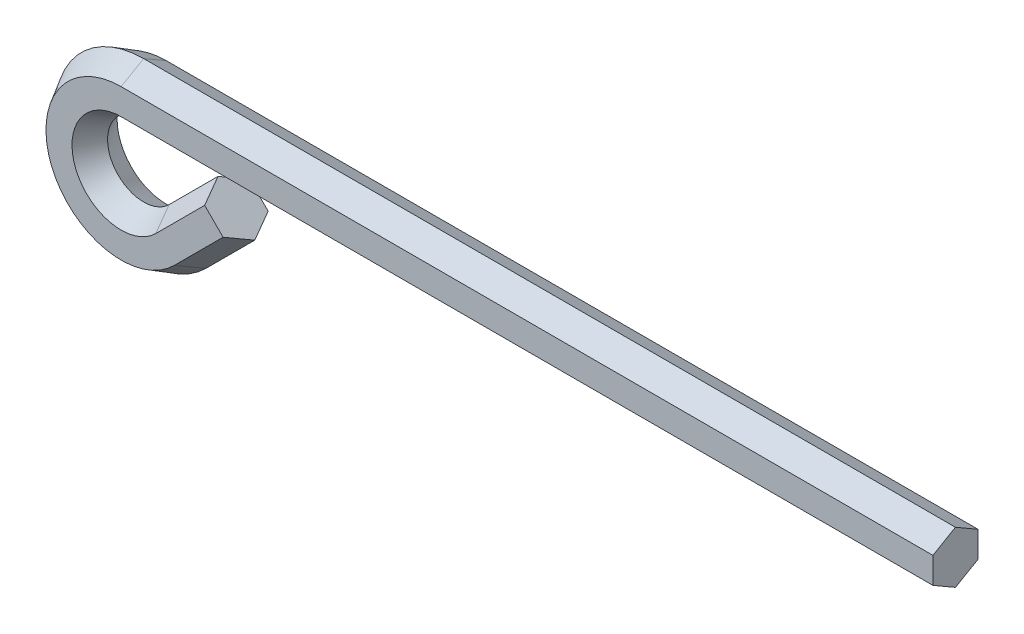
ISO-10303-21;
HEADER;
FILE_DESCRIPTION(('STEP AP214'),'2;1');
FILE_NAME('part.step','',(''),(''),'','','');
FILE_SCHEMA(('AUTOMOTIVE_DESIGN { 1 0 10303 214 1 1 1 1 }'));
ENDSEC;
DATA;
#1=APPLICATION_CONTEXT('core data for automotive mechanical design processes');
#2=APPLICATION_PROTOCOL_DEFINITION('international standard','automotive_design',2000,#1);
#3=PRODUCT_CONTEXT('',#1,'mechanical');
#4=PRODUCT('Part','Part','',(#3));
#5=PRODUCT_RELATED_PRODUCT_CATEGORY('part','',(#4));
#6=PRODUCT_DEFINITION_FORMATION('','',#4);
#7=PRODUCT_DEFINITION_CONTEXT('part definition',#1,'design');
#8=PRODUCT_DEFINITION('design','',#6,#7);
#9=PRODUCT_DEFINITION_SHAPE('','',#8);
#10=(LENGTH_UNIT() NAMED_UNIT(*) SI_UNIT(.MILLI.,.METRE.));
#11=(NAMED_UNIT(*) PLANE_ANGLE_UNIT() SI_UNIT($,.RADIAN.));
#12=(NAMED_UNIT(*) SI_UNIT($,.STERADIAN.) SOLID_ANGLE_UNIT());
#13=UNCERTAINTY_MEASURE_WITH_UNIT(LENGTH_MEASURE(1.E-05),#10,'distance_accuracy_value','');
#14=(GEOMETRIC_REPRESENTATION_CONTEXT(3) GLOBAL_UNCERTAINTY_ASSIGNED_CONTEXT((#13)) GLOBAL_UNIT_ASSIGNED_CONTEXT((#10,
#11,#12)) REPRESENTATION_CONTEXT('',''));
#15=CARTESIAN_POINT('',(0.,0.,0.));
#16=DIRECTION('',(0.,0.,1.));
#17=DIRECTION('',(1.,0.,0.));
#18=AXIS2_PLACEMENT_3D('',#15,#16,#17);
#19=CARTESIAN_POINT('',(5.89028930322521,-5.89028930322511,-2.5));
#20=DIRECTION('',(-0.612372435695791,0.612372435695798,0.5));
#21=DIRECTION('',(-0.707106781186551,-0.707106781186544,0.));
#22=AXIS2_PLACEMENT_3D('',#19,#20,#21);
#23=PLANE('',#22);
#24=DIRECTION('',(0.353553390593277,-0.353553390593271,0.866025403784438));
#25=VECTOR('',#24,1.);
#26=CARTESIAN_POINT('',(5.89028930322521,-5.89028930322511,-2.5));
#27=LINE('',#26,#25);
#28=CARTESIAN_POINT('',(5.89028930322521,-5.89028930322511,-2.5));
#29=VERTEX_POINT('',#28);
#30=CARTESIAN_POINT('',(6.91091002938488,-6.91091002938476,0.));
#31=VERTEX_POINT('',#30);
#32=EDGE_CURVE('E133',#29,#31,#27,.T.);
#33=ORIENTED_EDGE('',*,*,#32,.F.);
#34=DIRECTION('',(0.707106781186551,0.707106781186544,0.));
#35=VECTOR('',#34,1.);
#36=CARTESIAN_POINT('',(5.89028930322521,-5.89028930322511,-2.5));
#37=LINE('',#36,#35);
#38=CARTESIAN_POINT('',(11.3045028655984,-0.476075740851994,-2.5));
#39=VERTEX_POINT('',#38);
#40=EDGE_CURVE('E42',#29,#39,#37,.T.);
#41=ORIENTED_EDGE('',*,*,#40,.T.);
#42=DIRECTION('',(0.353553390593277,-0.353553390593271,0.866025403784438));
#43=VECTOR('',#42,1.);
#44=CARTESIAN_POINT('',(11.3045028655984,-0.476075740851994,-2.5));
#45=LINE('',#44,#43);
#46=CARTESIAN_POINT('',(12.3251235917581,-1.49669646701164,0.));
#47=VERTEX_POINT('',#46);
#48=EDGE_CURVE('E49',#39,#47,#45,.T.);
#49=ORIENTED_EDGE('',*,*,#48,.T.);
#50=DIRECTION('',(0.707106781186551,0.707106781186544,0.));
#51=VECTOR('',#50,1.);
#52=CARTESIAN_POINT('',(6.91091002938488,-6.91091002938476,0.));
#53=LINE('',#52,#51);
#54=EDGE_CURVE('E11',#31,#47,#53,.T.);
#55=ORIENTED_EDGE('',*,*,#54,.F.);
#56=EDGE_LOOP('',(#33,#41,#49,#55));
#57=FACE_BOUND('',#56,.T.);
#58=ADVANCED_FACE('F34',(#57),#23,.F.);
#59=CARTESIAN_POINT('',(2.82842712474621,-2.82842712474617,0.));
#60=DIRECTION('',(0.612372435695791,-0.612372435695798,0.5));
#61=DIRECTION('',(0.707106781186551,0.707106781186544,0.));
#62=AXIS2_PLACEMENT_3D('',#59,#60,#61);
#63=PLANE('',#62);
#64=DIRECTION('',(0.353553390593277,-0.353553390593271,-0.866025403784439));
#65=VECTOR('',#64,1.);
#66=CARTESIAN_POINT('',(2.82842712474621,-2.82842712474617,0.));
#67=LINE('',#66,#65);
#68=CARTESIAN_POINT('',(2.82842712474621,-2.82842712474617,0.));
#69=VERTEX_POINT('',#68);
#70=CARTESIAN_POINT('',(3.84904785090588,-3.84904785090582,-2.5));
#71=VERTEX_POINT('',#70);
#72=EDGE_CURVE('E212',#69,#71,#67,.T.);
#73=ORIENTED_EDGE('',*,*,#72,.F.);
#74=DIRECTION('',(0.707106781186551,0.707106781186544,0.));
#75=VECTOR('',#74,1.);
#76=CARTESIAN_POINT('',(2.82842712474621,-2.82842712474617,0.));
#77=LINE('',#76,#75);
#78=CARTESIAN_POINT('',(8.24264068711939,2.58578643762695,0.));
#79=VERTEX_POINT('',#78);
#80=EDGE_CURVE('E256',#69,#79,#77,.T.);
#81=ORIENTED_EDGE('',*,*,#80,.T.);
#82=DIRECTION('',(0.353553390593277,-0.353553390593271,-0.866025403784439));
#83=VECTOR('',#82,1.);
#84=CARTESIAN_POINT('',(8.24264068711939,2.58578643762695,0.));
#85=LINE('',#84,#83);
#86=CARTESIAN_POINT('',(9.26326141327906,1.5651657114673,-2.5));
#87=VERTEX_POINT('',#86);
#88=EDGE_CURVE('E243',#79,#87,#85,.T.);
#89=ORIENTED_EDGE('',*,*,#88,.T.);
#90=DIRECTION('',(0.707106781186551,0.707106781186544,0.));
#91=VECTOR('',#90,1.);
#92=CARTESIAN_POINT('',(3.84904785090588,-3.84904785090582,-2.5));
#93=LINE('',#92,#91);
#94=EDGE_CURVE('E260',#71,#87,#93,.T.);
#95=ORIENTED_EDGE('',*,*,#94,.F.);
#96=EDGE_LOOP('',(#73,#81,#89,#95));
#97=FACE_BOUND('',#96,.T.);
#98=ADVANCED_FACE('F282',(#97),#63,.F.);
#99=CARTESIAN_POINT('',(2.82842712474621,-2.82842712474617,0.));
#100=DIRECTION('',(-0.612372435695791,0.612372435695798,0.5));
#101=DIRECTION('',(-0.707106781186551,-0.707106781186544,0.));
#102=AXIS2_PLACEMENT_3D('',#99,#100,#101);
#103=PLANE('',#102);
#104=DIRECTION('',(0.353553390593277,-0.353553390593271,0.866025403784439));
#105=VECTOR('',#104,1.);
#106=CARTESIAN_POINT('',(2.82842712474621,-2.82842712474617,0.));
#107=LINE('',#106,#105);
#108=CARTESIAN_POINT('',(3.84904785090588,-3.84904785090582,2.5));
#109=VERTEX_POINT('',#108);
#110=EDGE_CURVE('E209',#69,#109,#107,.T.);
#111=ORIENTED_EDGE('',*,*,#110,.T.);
#112=DIRECTION('',(0.707106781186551,0.707106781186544,0.));
#113=VECTOR('',#112,1.);
#114=CARTESIAN_POINT('',(3.84904785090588,-3.84904785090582,2.5));
#115=LINE('',#114,#113);
#116=CARTESIAN_POINT('',(9.26326141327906,1.5651657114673,2.5));
#117=VERTEX_POINT('',#116);
#118=EDGE_CURVE('E252',#109,#117,#115,.T.);
#119=ORIENTED_EDGE('',*,*,#118,.T.);
#120=DIRECTION('',(0.353553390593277,-0.353553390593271,0.866025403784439));
#121=VECTOR('',#120,1.);
#122=CARTESIAN_POINT('',(8.24264068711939,2.58578643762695,0.));
#123=LINE('',#122,#121);
#124=EDGE_CURVE('E240',#79,#117,#123,.T.);
#125=ORIENTED_EDGE('',*,*,#124,.F.);
#126=ORIENTED_EDGE('',*,*,#80,.F.);
#127=EDGE_LOOP('',(#111,#119,#125,#126));
#128=FACE_BOUND('',#127,.T.);
#129=ADVANCED_FACE('F286',(#128),#103,.T.);
#130=CARTESIAN_POINT('',(5.89028930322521,-5.89028930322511,2.5));
#131=DIRECTION('',(0.612372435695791,-0.612372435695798,0.5));
#132=DIRECTION('',(0.707106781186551,0.707106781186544,0.));
#133=AXIS2_PLACEMENT_3D('',#130,#131,#132);
#134=PLANE('',#133);
#135=DIRECTION('',(0.353553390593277,-0.353553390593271,-0.866025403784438));
#136=VECTOR('',#135,1.);
#137=CARTESIAN_POINT('',(5.89028930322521,-5.89028930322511,2.5));
#138=LINE('',#137,#136);
#139=CARTESIAN_POINT('',(5.89028930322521,-5.89028930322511,2.5));
#140=VERTEX_POINT('',#139);
#141=EDGE_CURVE('E160',#140,#31,#138,.T.);
#142=ORIENTED_EDGE('',*,*,#141,.T.);
#143=ORIENTED_EDGE('',*,*,#54,.T.);
#144=DIRECTION('',(0.353553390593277,-0.353553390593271,-0.866025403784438));
#145=VECTOR('',#144,1.);
#146=CARTESIAN_POINT('',(11.3045028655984,-0.476075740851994,2.5));
#147=LINE('',#146,#145);
#148=CARTESIAN_POINT('',(11.3045028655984,-0.476075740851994,2.5));
#149=VERTEX_POINT('',#148);
#150=EDGE_CURVE('E137',#149,#47,#147,.T.);
#151=ORIENTED_EDGE('',*,*,#150,.F.);
#152=DIRECTION('',(0.707106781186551,0.707106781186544,0.));
#153=VECTOR('',#152,1.);
#154=CARTESIAN_POINT('',(5.89028930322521,-5.89028930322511,2.5));
#155=LINE('',#154,#153);
#156=EDGE_CURVE('E249',#140,#149,#155,.T.);
#157=ORIENTED_EDGE('',*,*,#156,.F.);
#158=EDGE_LOOP('',(#142,#143,#151,#157));
#159=FACE_BOUND('',#158,.T.);
#160=ADVANCED_FACE('F291',(#159),#134,.T.);
#161=CARTESIAN_POINT('',(0.,0.,-2.5));
#162=DIRECTION('',(0.,0.,1.));
#163=DIRECTION('',(1.,0.,0.));
#164=AXIS2_PLACEMENT_3D('',#161,#162,#163);
#165=CONICAL_SURFACE('',#164,8.33012701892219,0.523598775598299);
#166=DIRECTION('',(0.,0.5,0.866025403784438));
#167=VECTOR('',#166,1.);
#168=CARTESIAN_POINT('',(0.,8.33012701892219,-2.5));
#169=LINE('',#168,#167);
#170=CARTESIAN_POINT('',(0.,8.33012701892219,-2.5));
#171=VERTEX_POINT('',#170);
#172=CARTESIAN_POINT('',(0.,9.77350269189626,0.));
#173=VERTEX_POINT('',#172);
#174=EDGE_CURVE('E130',#171,#173,#169,.T.);
#175=ORIENTED_EDGE('',*,*,#174,.F.);
#176=CARTESIAN_POINT('',(0.,0.,-2.5));
#177=DIRECTION('',(0.,0.,1.));
#178=DIRECTION('',(1.,0.,0.));
#179=AXIS2_PLACEMENT_3D('',#176,#177,#178);
#180=CIRCLE('',#179,8.33012701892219);
#181=EDGE_CURVE('E138',#171,#29,#180,.T.);
#182=ORIENTED_EDGE('',*,*,#181,.T.);
#183=ORIENTED_EDGE('',*,*,#32,.T.);
#184=CARTESIAN_POINT('',(0.,0.,0.));
#185=DIRECTION('',(0.,0.,1.));
#186=DIRECTION('',(1.,0.,0.));
#187=AXIS2_PLACEMENT_3D('',#184,#185,#186);
#188=CIRCLE('',#187,9.77350269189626);
#189=EDGE_CURVE('E125',#173,#31,#188,.T.);
#190=ORIENTED_EDGE('',*,*,#189,.F.);
#191=EDGE_LOOP('',(#175,#182,#183,#190));
#192=FACE_BOUND('',#191,.T.);
#193=ADVANCED_FACE('F127',(#192),#165,.T.);
#194=CARTESIAN_POINT('',(0.,0.,0.));
#195=DIRECTION('',(0.,0.,-1.));
#196=DIRECTION('',(-1.,0.,0.));
#197=AXIS2_PLACEMENT_3D('',#194,#195,#196);
#198=CONICAL_SURFACE('',#197,4.,0.523598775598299);
#199=DIRECTION('',(0.,0.5,-0.866025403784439));
#200=VECTOR('',#199,1.);
#201=CARTESIAN_POINT('',(0.,4.,0.));
#202=LINE('',#201,#200);
#203=CARTESIAN_POINT('',(0.,4.,0.));
#204=VERTEX_POINT('',#203);
#205=CARTESIAN_POINT('',(0.,5.44337567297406,-2.5));
#206=VERTEX_POINT('',#205);
#207=EDGE_CURVE('E165',#204,#206,#202,.T.);
#208=ORIENTED_EDGE('',*,*,#207,.F.);
#209=CARTESIAN_POINT('',(0.,0.,0.));
#210=DIRECTION('',(0.,0.,1.));
#211=DIRECTION('',(1.,0.,0.));
#212=AXIS2_PLACEMENT_3D('',#209,#210,#211);
#213=CIRCLE('',#212,4.);
#214=EDGE_CURVE('E224',#204,#69,#213,.T.);
#215=ORIENTED_EDGE('',*,*,#214,.T.);
#216=ORIENTED_EDGE('',*,*,#72,.T.);
#217=CARTESIAN_POINT('',(0.,0.,-2.5));
#218=DIRECTION('',(0.,0.,1.));
#219=DIRECTION('',(1.,0.,0.));
#220=AXIS2_PLACEMENT_3D('',#217,#218,#219);
#221=CIRCLE('',#220,5.44337567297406);
#222=EDGE_CURVE('E228',#206,#71,#221,.T.);
#223=ORIENTED_EDGE('',*,*,#222,.F.);
#224=EDGE_LOOP('',(#208,#215,#216,#223));
#225=FACE_BOUND('',#224,.T.);
#226=ADVANCED_FACE('F278',(#225),#198,.F.);
#227=CARTESIAN_POINT('',(0.,0.,0.));
#228=DIRECTION('',(0.,0.,1.));
#229=DIRECTION('',(1.,0.,0.));
#230=AXIS2_PLACEMENT_3D('',#227,#228,#229);
#231=CONICAL_SURFACE('',#230,4.,0.523598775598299);
#232=DIRECTION('',(0.,0.5,0.866025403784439));
#233=VECTOR('',#232,1.);
#234=CARTESIAN_POINT('',(0.,4.,0.));
#235=LINE('',#234,#233);
#236=CARTESIAN_POINT('',(0.,5.44337567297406,2.5));
#237=VERTEX_POINT('',#236);
#238=EDGE_CURVE('E172',#204,#237,#235,.T.);
#239=ORIENTED_EDGE('',*,*,#238,.T.);
#240=CARTESIAN_POINT('',(0.,0.,2.5));
#241=DIRECTION('',(0.,0.,1.));
#242=DIRECTION('',(1.,0.,0.));
#243=AXIS2_PLACEMENT_3D('',#240,#241,#242);
#244=CIRCLE('',#243,5.44337567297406);
#245=EDGE_CURVE('E220',#237,#109,#244,.T.);
#246=ORIENTED_EDGE('',*,*,#245,.T.);
#247=ORIENTED_EDGE('',*,*,#110,.F.);
#248=ORIENTED_EDGE('',*,*,#214,.F.);
#249=EDGE_LOOP('',(#239,#246,#247,#248));
#250=FACE_BOUND('',#249,.T.);
#251=ADVANCED_FACE('F284',(#250),#231,.F.);
#252=CARTESIAN_POINT('',(0.,0.,2.5));
#253=DIRECTION('',(0.,0.,-1.));
#254=DIRECTION('',(-1.,0.,0.));
#255=AXIS2_PLACEMENT_3D('',#252,#253,#254);
#256=CONICAL_SURFACE('',#255,8.33012701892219,0.523598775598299);
#257=DIRECTION('',(0.,0.5,-0.866025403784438));
#258=VECTOR('',#257,1.);
#259=CARTESIAN_POINT('',(0.,8.33012701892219,2.5));
#260=LINE('',#259,#258);
#261=CARTESIAN_POINT('',(0.,8.33012701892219,2.5));
#262=VERTEX_POINT('',#261);
#263=EDGE_CURVE('E141',#262,#173,#260,.T.);
#264=ORIENTED_EDGE('',*,*,#263,.T.);
#265=ORIENTED_EDGE('',*,*,#189,.T.);
#266=ORIENTED_EDGE('',*,*,#141,.F.);
#267=CARTESIAN_POINT('',(0.,0.,2.5));
#268=DIRECTION('',(0.,0.,1.));
#269=DIRECTION('',(1.,0.,0.));
#270=AXIS2_PLACEMENT_3D('',#267,#268,#269);
#271=CIRCLE('',#270,8.33012701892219);
#272=EDGE_CURVE('E145',#262,#140,#271,.T.);
#273=ORIENTED_EDGE('',*,*,#272,.F.);
#274=EDGE_LOOP('',(#264,#265,#266,#273));
#275=FACE_BOUND('',#274,.T.);
#276=ADVANCED_FACE('F143',(#275),#256,.T.);
#277=CARTESIAN_POINT('',(0.,8.33012701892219,2.5));
#278=DIRECTION('',(0.,-0.866025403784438,-0.5));
#279=DIRECTION('',(0.,0.5,-0.866025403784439));
#280=AXIS2_PLACEMENT_3D('',#277,#278,#279);
#281=PLANE('',#280);
#282=DIRECTION('',(0.,0.5,-0.866025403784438));
#283=VECTOR('',#282,1.);
#284=CARTESIAN_POINT('',(90.,8.3301270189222,2.5));
#285=LINE('',#284,#283);
#286=CARTESIAN_POINT('',(90.,8.3301270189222,2.5));
#287=VERTEX_POINT('',#286);
#288=CARTESIAN_POINT('',(90.,9.77350269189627,0.));
#289=VERTEX_POINT('',#288);
#290=EDGE_CURVE('E155',#287,#289,#285,.T.);
#291=ORIENTED_EDGE('',*,*,#290,.T.);
#292=DIRECTION('',(1.,0.,0.));
#293=VECTOR('',#292,1.);
#294=CARTESIAN_POINT('',(0.,9.77350269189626,0.));
#295=LINE('',#294,#293);
#296=EDGE_CURVE('E152',#173,#289,#295,.T.);
#297=ORIENTED_EDGE('',*,*,#296,.F.);
#298=ORIENTED_EDGE('',*,*,#263,.F.);
#299=DIRECTION('',(1.,0.,0.));
#300=VECTOR('',#299,1.);
#301=CARTESIAN_POINT('',(0.,8.33012701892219,2.5));
#302=LINE('',#301,#300);
#303=EDGE_CURVE('E178',#262,#287,#302,.T.);
#304=ORIENTED_EDGE('',*,*,#303,.T.);
#305=EDGE_LOOP('',(#291,#297,#298,#304));
#306=FACE_BOUND('',#305,.T.);
#307=ADVANCED_FACE('F153',(#306),#281,.F.);
#308=CARTESIAN_POINT('',(0.,8.33012701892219,-2.5));
#309=DIRECTION('',(0.,0.866025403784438,-0.5));
#310=DIRECTION('',(0.,0.5,0.866025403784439));
#311=AXIS2_PLACEMENT_3D('',#308,#309,#310);
#312=PLANE('',#311);
#313=DIRECTION('',(0.,0.5,0.866025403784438));
#314=VECTOR('',#313,1.);
#315=CARTESIAN_POINT('',(90.,8.3301270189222,-2.5));
#316=LINE('',#315,#314);
#317=CARTESIAN_POINT('',(90.,8.3301270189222,-2.5));
#318=VERTEX_POINT('',#317);
#319=EDGE_CURVE('E180',#318,#289,#316,.T.);
#320=ORIENTED_EDGE('',*,*,#319,.F.);
#321=DIRECTION('',(1.,0.,0.));
#322=VECTOR('',#321,1.);
#323=CARTESIAN_POINT('',(0.,8.33012701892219,-2.5));
#324=LINE('',#323,#322);
#325=EDGE_CURVE('E161',#171,#318,#324,.T.);
#326=ORIENTED_EDGE('',*,*,#325,.F.);
#327=ORIENTED_EDGE('',*,*,#174,.T.);
#328=ORIENTED_EDGE('',*,*,#296,.T.);
#329=EDGE_LOOP('',(#320,#326,#327,#328));
#330=FACE_BOUND('',#329,.T.);
#331=ADVANCED_FACE('F163',(#330),#312,.T.);
#332=CARTESIAN_POINT('',(0.,5.44337567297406,-2.5));
#333=DIRECTION('',(0.,0.,-1.));
#334=DIRECTION('',(-1.,0.,0.));
#335=AXIS2_PLACEMENT_3D('',#332,#333,#334);
#336=PLANE('',#335);
#337=DIRECTION('',(0.,1.,0.));
#338=VECTOR('',#337,1.);
#339=CARTESIAN_POINT('',(90.,5.44337567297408,-2.5));
#340=LINE('',#339,#338);
#341=CARTESIAN_POINT('',(90.,5.44337567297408,-2.5));
#342=VERTEX_POINT('',#341);
#343=EDGE_CURVE('E183',#342,#318,#340,.T.);
#344=ORIENTED_EDGE('',*,*,#343,.F.);
#345=DIRECTION('',(1.,0.,0.));
#346=VECTOR('',#345,1.);
#347=CARTESIAN_POINT('',(0.,5.44337567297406,-2.5));
#348=LINE('',#347,#346);
#349=EDGE_CURVE('E201',#206,#342,#348,.T.);
#350=ORIENTED_EDGE('',*,*,#349,.F.);
#351=ORIENTED_EDGE('',*,*,#222,.T.);
#352=ORIENTED_EDGE('',*,*,#94,.T.);
#353=DIRECTION('',(0.707106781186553,-0.707106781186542,0.));
#354=VECTOR('',#353,1.);
#355=CARTESIAN_POINT('',(9.26326141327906,1.5651657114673,-2.5));
#356=LINE('',#355,#354);
#357=EDGE_CURVE('E57',#87,#39,#356,.T.);
#358=ORIENTED_EDGE('',*,*,#357,.T.);
#359=ORIENTED_EDGE('',*,*,#40,.F.);
#360=ORIENTED_EDGE('',*,*,#181,.F.);
#361=ORIENTED_EDGE('',*,*,#325,.T.);
#362=EDGE_LOOP('',(#344,#350,#351,#352,#358,#359,#360,#361));
#363=FACE_BOUND('',#362,.T.);
#364=ADVANCED_FACE('F265',(#363),#336,.T.);
#365=CARTESIAN_POINT('',(0.,4.,0.));
#366=DIRECTION('',(0.,-0.866025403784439,-0.5));
#367=DIRECTION('',(0.,0.5,-0.866025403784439));
#368=AXIS2_PLACEMENT_3D('',#365,#366,#367);
#369=PLANE('',#368);
#370=DIRECTION('',(0.,0.5,-0.866025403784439));
#371=VECTOR('',#370,1.);
#372=CARTESIAN_POINT('',(90.,4.00000000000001,0.));
#373=LINE('',#372,#371);
#374=CARTESIAN_POINT('',(90.,4.00000000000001,0.));
#375=VERTEX_POINT('',#374);
#376=EDGE_CURVE('E186',#375,#342,#373,.T.);
#377=ORIENTED_EDGE('',*,*,#376,.F.);
#378=DIRECTION('',(1.,0.,0.));
#379=VECTOR('',#378,1.);
#380=CARTESIAN_POINT('',(0.,4.,0.));
#381=LINE('',#380,#379);
#382=EDGE_CURVE('E199',#204,#375,#381,.T.);
#383=ORIENTED_EDGE('',*,*,#382,.F.);
#384=ORIENTED_EDGE('',*,*,#207,.T.);
#385=ORIENTED_EDGE('',*,*,#349,.T.);
#386=EDGE_LOOP('',(#377,#383,#384,#385));
#387=FACE_BOUND('',#386,.T.);
#388=ADVANCED_FACE('F274',(#387),#369,.T.);
#389=CARTESIAN_POINT('',(0.,4.,0.));
#390=DIRECTION('',(0.,0.866025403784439,-0.5));
#391=DIRECTION('',(0.,0.5,0.866025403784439));
#392=AXIS2_PLACEMENT_3D('',#389,#390,#391);
#393=PLANE('',#392);
#394=DIRECTION('',(0.,0.5,0.866025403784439));
#395=VECTOR('',#394,1.);
#396=CARTESIAN_POINT('',(90.,4.00000000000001,0.));
#397=LINE('',#396,#395);
#398=CARTESIAN_POINT('',(90.,5.44337567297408,2.5));
#399=VERTEX_POINT('',#398);
#400=EDGE_CURVE('E189',#375,#399,#397,.T.);
#401=ORIENTED_EDGE('',*,*,#400,.T.);
#402=DIRECTION('',(1.,0.,0.));
#403=VECTOR('',#402,1.);
#404=CARTESIAN_POINT('',(0.,5.44337567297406,2.5));
#405=LINE('',#404,#403);
#406=EDGE_CURVE('E195',#237,#399,#405,.T.);
#407=ORIENTED_EDGE('',*,*,#406,.F.);
#408=ORIENTED_EDGE('',*,*,#238,.F.);
#409=ORIENTED_EDGE('',*,*,#382,.T.);
#410=EDGE_LOOP('',(#401,#407,#408,#409));
#411=FACE_BOUND('',#410,.T.);
#412=ADVANCED_FACE('F296',(#411),#393,.F.);
#413=CARTESIAN_POINT('',(0.,5.44337567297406,2.5));
#414=DIRECTION('',(0.,0.,-1.));
#415=DIRECTION('',(-1.,0.,0.));
#416=AXIS2_PLACEMENT_3D('',#413,#414,#415);
#417=PLANE('',#416);
#418=DIRECTION('',(0.,1.,0.));
#419=VECTOR('',#418,1.);
#420=CARTESIAN_POINT('',(90.,5.44337567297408,2.5));
#421=LINE('',#420,#419);
#422=EDGE_CURVE('E149',#399,#287,#421,.T.);
#423=ORIENTED_EDGE('',*,*,#422,.T.);
#424=ORIENTED_EDGE('',*,*,#303,.F.);
#425=ORIENTED_EDGE('',*,*,#272,.T.);
#426=ORIENTED_EDGE('',*,*,#156,.T.);
#427=DIRECTION('',(0.707106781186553,-0.707106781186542,0.));
#428=VECTOR('',#427,1.);
#429=CARTESIAN_POINT('',(9.26326141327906,1.5651657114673,2.5));
#430=LINE('',#429,#428);
#431=EDGE_CURVE('E236',#117,#149,#430,.T.);
#432=ORIENTED_EDGE('',*,*,#431,.F.);
#433=ORIENTED_EDGE('',*,*,#118,.F.);
#434=ORIENTED_EDGE('',*,*,#245,.F.);
#435=ORIENTED_EDGE('',*,*,#406,.T.);
#436=EDGE_LOOP('',(#423,#424,#425,#426,#432,#433,#434,#435));
#437=FACE_BOUND('',#436,.T.);
#438=ADVANCED_FACE('F293',(#437),#417,.F.);
#439=CARTESIAN_POINT('',(12.3251235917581,-1.49669646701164,0.));
#440=DIRECTION('',(-0.707106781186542,-0.707106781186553,0.));
#441=DIRECTION('',(0.,0.,-1.));
#442=AXIS2_PLACEMENT_3D('',#439,#440,#441);
#443=PLANE('',#442);
#444=ORIENTED_EDGE('',*,*,#150,.T.);
#445=ORIENTED_EDGE('',*,*,#48,.F.);
#446=ORIENTED_EDGE('',*,*,#357,.F.);
#447=ORIENTED_EDGE('',*,*,#88,.F.);
#448=ORIENTED_EDGE('',*,*,#124,.T.);
#449=ORIENTED_EDGE('',*,*,#431,.T.);
#450=EDGE_LOOP('',(#444,#445,#446,#447,#448,#449));
#451=FACE_BOUND('',#450,.T.);
#452=ADVANCED_FACE('F289',(#451),#443,.F.);
#453=CARTESIAN_POINT('',(90.,9.77350269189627,0.));
#454=DIRECTION('',(1.,0.,0.));
#455=DIRECTION('',(0.,0.,-1.));
#456=AXIS2_PLACEMENT_3D('',#453,#454,#455);
#457=PLANE('',#456);
#458=ORIENTED_EDGE('',*,*,#290,.F.);
#459=ORIENTED_EDGE('',*,*,#422,.F.);
#460=ORIENTED_EDGE('',*,*,#400,.F.);
#461=ORIENTED_EDGE('',*,*,#376,.T.);
#462=ORIENTED_EDGE('',*,*,#343,.T.);
#463=ORIENTED_EDGE('',*,*,#319,.T.);
#464=EDGE_LOOP('',(#458,#459,#460,#461,#462,#463));
#465=FACE_BOUND('',#464,.T.);
#466=ADVANCED_FACE('F268',(#465),#457,.T.);
#467=CLOSED_SHELL('',(#58,#98,#129,#160,#193,#226,#251,#276,#307,#331,#364,#388,#412,#438,#452,#466));
#468=MANIFOLD_SOLID_BREP('B2',#467);
#469=ADVANCED_BREP_SHAPE_REPRESENTATION('',(#18,#468),#14);
#470=SHAPE_DEFINITION_REPRESENTATION(#9,#469);
ENDSEC;
END-ISO-10303-21;
